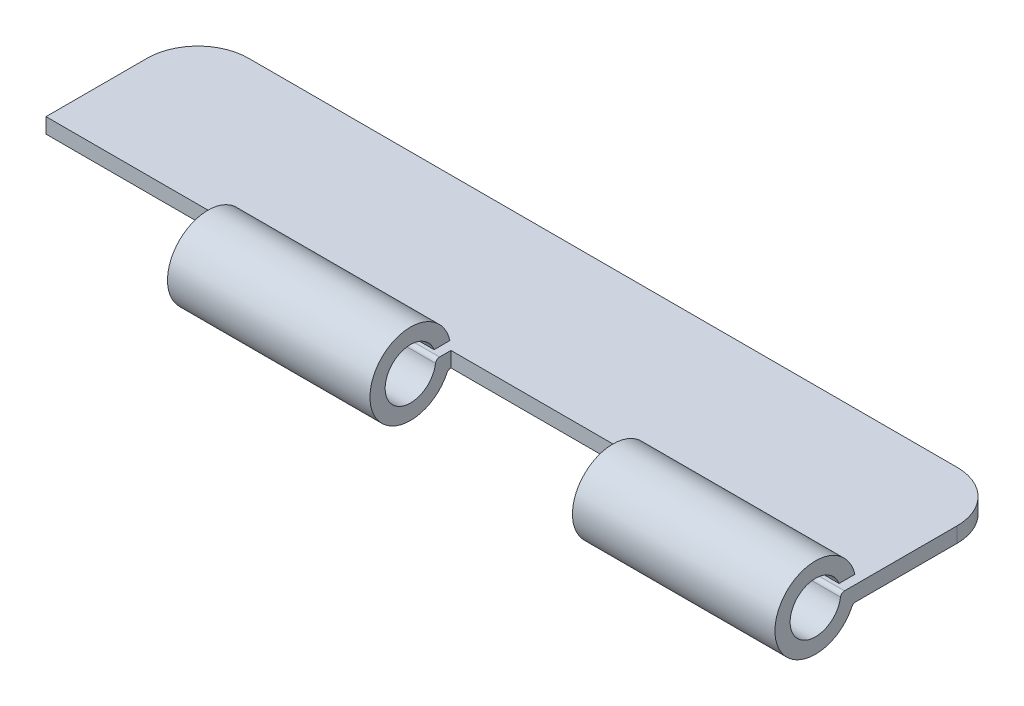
from build123d import *

# Parameters (mm, degrees)
BOSS_EXTRUDE1_DEPTH = 1.5
BOSS_EXTRUDE2_DEPTH = 20
LPATTERN1_COUNT     = 2
LPATTERN1_PITCH     = 40


with BuildPart() as part:
    # Sketch1 → Boss-Extrude1 (new body)
    with BuildSketch(Plane(origin=(0, 0, 0), x_dir=(1, 0, 0), z_dir=(0, 1, 0))):
        with BuildLine():
            Line((-40, -17.5), (40, -17.5))
            Line((40, -17.5), (40, -7.5))
            ThreePointArc((40, -7.5), (38.535533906, -3.964466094), (35, -2.5))
            Line((35, -2.5), (-35, -2.5))
            ThreePointArc((-35, -2.5), (-38.535533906, -3.964466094), (-40, -7.5))
            Line((-40, -7.5), (-40, -17.5))
        make_face()
    extrude(amount=BOSS_EXTRUDE1_DEPTH)

    # Sketch2 → Boss-Extrude2 (add)
    with BuildSketch(Plane(origin=(40, 0, 0), x_dir=(0, 0, -1), z_dir=(1, 0, 0))):
        with BuildLine():
            Line((-17.601819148, 2.396764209), (-19.166373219, 2.396764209))
            ThreePointArc((-19.166373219, 2.396764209), (-23.983700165, 1.214985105), (-19.023895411, 1.155172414))
            ThreePointArc((-19.023895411, 1.155172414), (-18.890331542, 1.401719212), (-18.627718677, 1.5))
            Line((-18.627718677, 1.5), (-17.5, 1.5))
            Line((-17.5, 1.5), (-17.5, 0))
            Line((-17.5, 0), (-17.531373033, 0))
            ThreePointArc((-17.531373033, 0), (-17.74457375, -0.061554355), (-17.892157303, -0.227272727))
            ThreePointArc((-17.892157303, -0.227272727), (-25.475737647, 1.939897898), (-17.601819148, 2.396764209))
        make_face()
    boss_extrude2 = extrude(amount=-BOSS_EXTRUDE2_DEPTH)

    # LPattern1: Boss-Extrude2 ×2
    with Locations(*[(-i * LPATTERN1_PITCH, 0, 0) for i in range(1, LPATTERN1_COUNT)]):
        add(boss_extrude2)


solid = part.part
